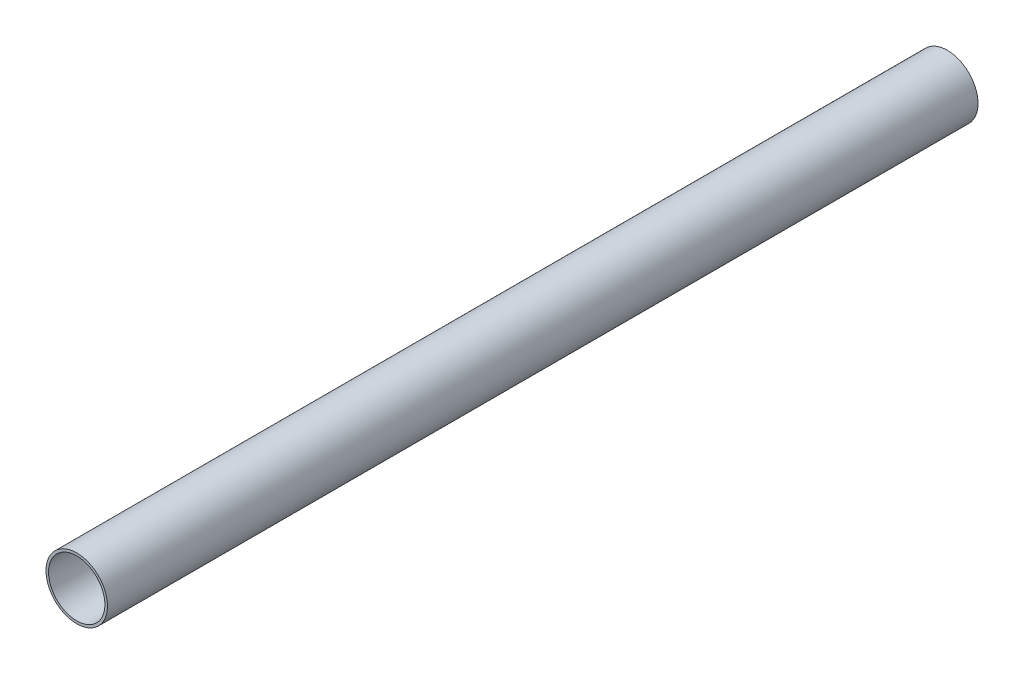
from build123d import *

# Parameters (mm, degrees)
ESQUISSE1_R        = 30
ESQUISSE1_R_2      = 27.5
EXTRU_MINCE1_DEPTH = 425


with BuildPart() as part:
    # Esquisse1 → Extru.-Mince1 (new, symmetric)
    with BuildSketch(Plane.XY):
        Circle(ESQUISSE1_R)
        Circle(ESQUISSE1_R_2, mode=Mode.SUBTRACT)
    extrude(amount=EXTRU_MINCE1_DEPTH, both=True)


solid = part.part
